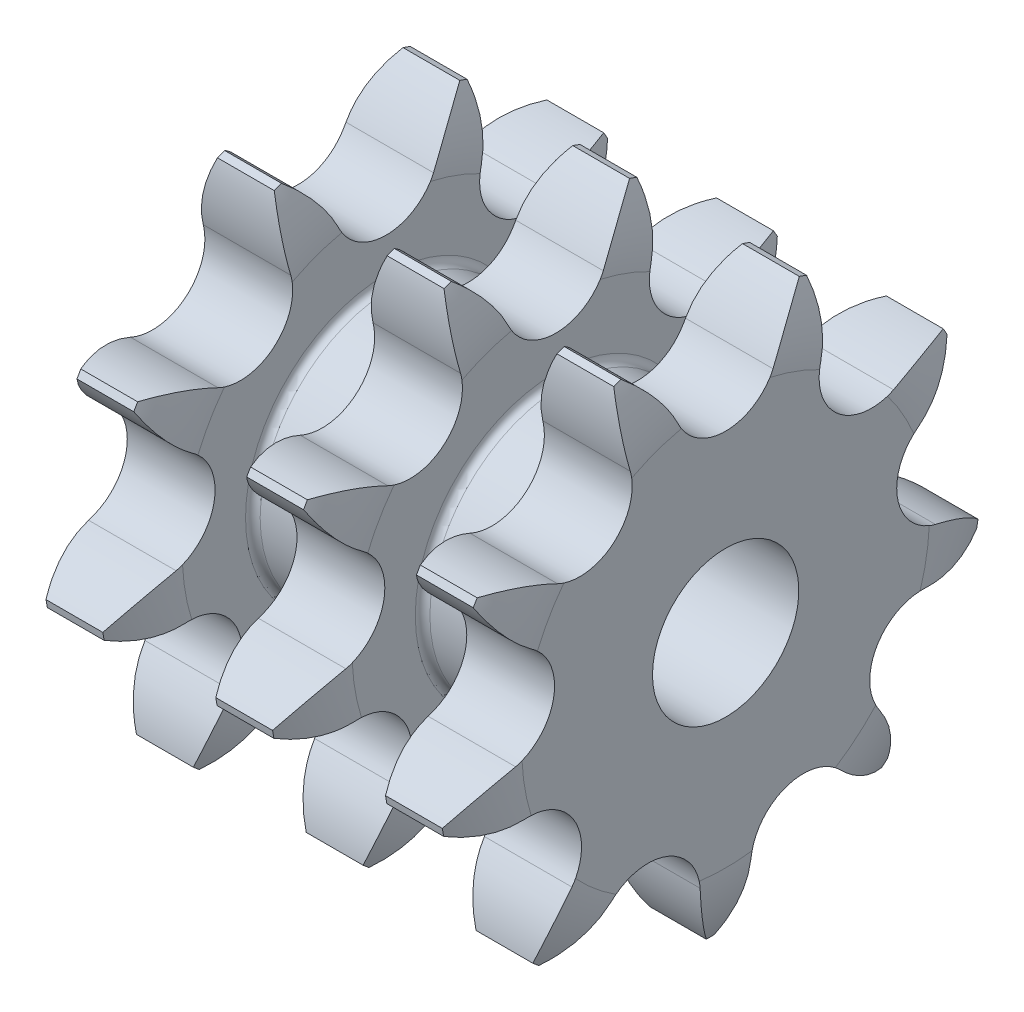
from build123d import *

# Parameters (mm, degrees)
GROOVES_COUNT   = 2
GROOVES_PITCH   = 13.92
TOOTHCUT_DEPTH  = 48.093600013
TEETHCUTS_COUNT = 9
TEETHCUTS_ANGLE = 320
BORSKE_R        = 6
BORE_DEPTH      = 37.2405


with BuildPart() as part:
    # BasProSke → Base-Revolve (revolve)
    with BuildSketch(Plane(origin=(0, 0, 0), x_dir=(1, 0, 0), z_dir=(0, 1, 0)), mode=Mode.PRIVATE) as base_revolve_sk:
        with BuildLine():
            Line((0, 0), (0, 16.712856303))
            ThreePointArc((0, 16.712856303), (0.321571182, 19.552662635), (1.27, 22.248657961))
            Line((1.27, 22.248657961), (33.77, 22.248657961))
            ThreePointArc((33.77, 22.248657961), (34.718428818, 19.552662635), (35.04, 16.712856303))
            Line((35.04, 16.712856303), (35.04, 0))
            Line((35.04, 0), (0, 0))
        make_face()
    revolve(base_revolve_sk.sketch.rotate(Axis((-10, 0, 0), (1, 0, 0)), 180), axis=Axis((-10, 0, 0), (1, 0, 0)))

    # GrvSke → Groove (revolve, cut)
    with BuildSketch(Plane(origin=(0, 0, 0), x_dir=(1, 0, 0), z_dir=(0, 1, 0)), mode=Mode.PRIVATE) as groove_sk:
        with BuildLine():
            Line((7.2, 16.712856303), (7.2, 11.530481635))
            ThreePointArc((7.2, 11.530481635), (7.375735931, 11.106217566), (7.8, 10.930481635))
            Line((7.8, 10.930481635), (13.32, 10.930481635))
            ThreePointArc((13.32, 10.930481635), (13.744264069, 11.106217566), (13.92, 11.530481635))
            Line((13.92, 11.530481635), (13.92, 16.712856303))
            ThreePointArc((13.92, 16.712856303), (14.241571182, 19.552662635), (15.19, 22.248657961))
            Line((15.19, 22.248657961), (5.93, 22.248657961))
            ThreePointArc((5.93, 22.248657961), (6.878428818, 19.552662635), (7.2, 16.712856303))
        make_face()
    groove = revolve(groove_sk.sketch.rotate(Axis((0, 0, 0), (1, 0, 0)), 180), axis=Axis((0, 0, 0), (1, 0, 0)), mode=Mode.SUBTRACT)

    # Grooves: Groove ×2
    with Locations(*[(i * GROOVES_PITCH, 0, 0) for i in range(1, GROOVES_COUNT)]):
        add(groove, mode=Mode.SUBTRACT)

    # TooCutSke → ToothCut (cut, through all)
    with BuildSketch(Plane(origin=(0, 0, 0), x_dir=(0, 0, -1), z_dir=(1, 0, 0))):
        with BuildLine():
            ThreePointArc((3.89490303, 16.792484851), (5.53909395, 19.346647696), (7.807509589, 21.366895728))
            ThreePointArc((7.807509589, 21.366895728), (0, 22.748657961), (-7.807509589, 21.366895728))
            ThreePointArc((-7.807509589, 21.366895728), (-5.53909395, 19.346647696), (-3.89490303, 16.792484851))
            ThreePointArc((-3.89490303, 16.792484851), (0, 14.311157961), (3.89490303, 16.792484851))
        make_face()
    toothcut = extrude(amount=TOOTHCUT_DEPTH, mode=Mode.SUBTRACT)

    # TeethCuts: ToothCut ×9 about axis
    teethcuts_axis = Axis((-10, 0, 0), (1, 0, 0))
    for i in range(1, TEETHCUTS_COUNT):
        add(toothcut.rotate(teethcuts_axis, i * TEETHCUTS_ANGLE / (TEETHCUTS_COUNT - 1)), mode=Mode.SUBTRACT)

    # BorSke → Bore (cut, symmetric)
    with BuildSketch(Plane(origin=(0, 0, 0), x_dir=(0, 0, -1), z_dir=(1, 0, 0))):
        with Locations(Location((0, 0, 0), (0, 0, 180))):
            Circle(BORSKE_R)
    extrude(amount=BORE_DEPTH, both=True, mode=Mode.SUBTRACT)


solid = part.part
